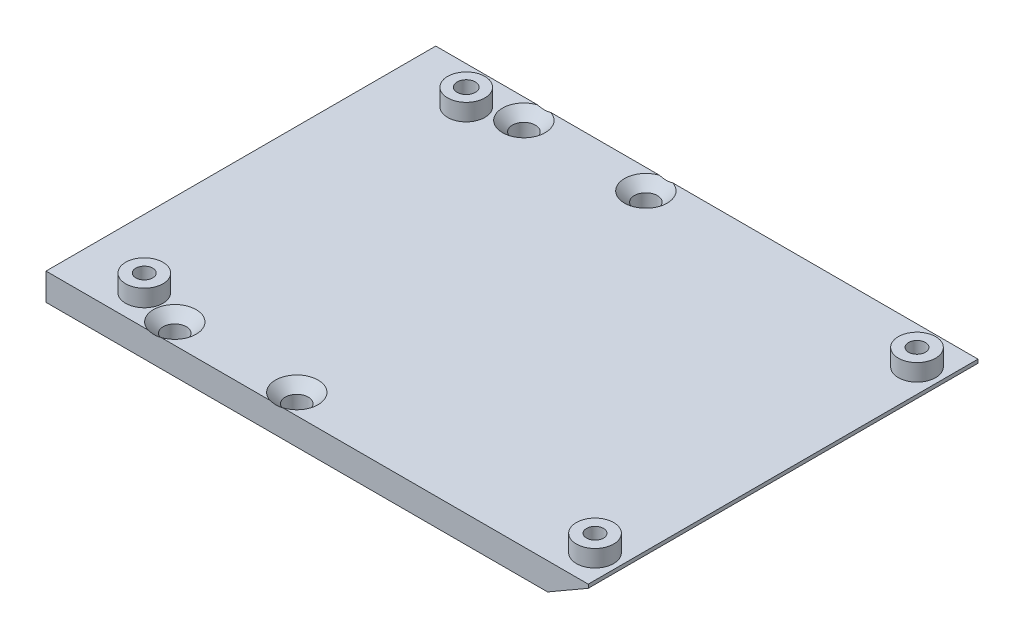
ISO-10303-21;
HEADER;
FILE_DESCRIPTION(('STEP AP214'),'2;1');
FILE_NAME('part.step','',(''),(''),'','','');
FILE_SCHEMA(('AUTOMOTIVE_DESIGN { 1 0 10303 214 1 1 1 1 }'));
ENDSEC;
DATA;
#1=APPLICATION_CONTEXT('core data for automotive mechanical design processes');
#2=APPLICATION_PROTOCOL_DEFINITION('international standard','automotive_design',2000,#1);
#3=PRODUCT_CONTEXT('',#1,'mechanical');
#4=PRODUCT('Part','Part','',(#3));
#5=PRODUCT_RELATED_PRODUCT_CATEGORY('part','',(#4));
#6=PRODUCT_DEFINITION_FORMATION('','',#4);
#7=PRODUCT_DEFINITION_CONTEXT('part definition',#1,'design');
#8=PRODUCT_DEFINITION('design','',#6,#7);
#9=PRODUCT_DEFINITION_SHAPE('','',#8);
#10=(LENGTH_UNIT() NAMED_UNIT(*) SI_UNIT(.MILLI.,.METRE.));
#11=(NAMED_UNIT(*) PLANE_ANGLE_UNIT() SI_UNIT($,.RADIAN.));
#12=(NAMED_UNIT(*) SI_UNIT($,.STERADIAN.) SOLID_ANGLE_UNIT());
#13=UNCERTAINTY_MEASURE_WITH_UNIT(LENGTH_MEASURE(1.E-05),#10,'distance_accuracy_value','');
#14=(GEOMETRIC_REPRESENTATION_CONTEXT(3) GLOBAL_UNCERTAINTY_ASSIGNED_CONTEXT((#13)) GLOBAL_UNIT_ASSIGNED_CONTEXT((#10,
#11,#12)) REPRESENTATION_CONTEXT('',''));
#15=CARTESIAN_POINT('',(0.,0.,0.));
#16=DIRECTION('',(0.,0.,1.));
#17=DIRECTION('',(1.,0.,0.));
#18=AXIS2_PLACEMENT_3D('',#15,#16,#17);
#19=CARTESIAN_POINT('',(80.,4.,0.));
#20=DIRECTION('',(-1.,0.,0.));
#21=DIRECTION('',(0.,0.,1.));
#22=AXIS2_PLACEMENT_3D('',#19,#20,#21);
#23=PLANE('',#22);
#24=DIRECTION('',(0.,0.,1.));
#25=VECTOR('',#24,1.);
#26=CARTESIAN_POINT('',(80.,3.46410161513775,0.));
#27=LINE('',#26,#25);
#28=CARTESIAN_POINT('',(80.,3.46410161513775,-2.));
#29=VERTEX_POINT('',#28);
#30=CARTESIAN_POINT('',(80.,3.46410161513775,55.5));
#31=VERTEX_POINT('',#30);
#32=EDGE_CURVE('E402',#29,#31,#27,.T.);
#33=ORIENTED_EDGE('',*,*,#32,.F.);
#34=DIRECTION('',(0.,-1.,0.));
#35=VECTOR('',#34,1.);
#36=CARTESIAN_POINT('',(80.,3.46410161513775,-2.));
#37=LINE('',#36,#35);
#38=CARTESIAN_POINT('',(80.,4.,-2.));
#39=VERTEX_POINT('',#38);
#40=EDGE_CURVE('E128',#39,#29,#37,.T.);
#41=ORIENTED_EDGE('',*,*,#40,.F.);
#42=DIRECTION('',(0.,0.,-1.));
#43=VECTOR('',#42,1.);
#44=CARTESIAN_POINT('',(80.,4.,0.));
#45=LINE('',#44,#43);
#46=CARTESIAN_POINT('',(80.,4.,55.5));
#47=VERTEX_POINT('',#46);
#48=EDGE_CURVE('E351',#47,#39,#45,.T.);
#49=ORIENTED_EDGE('',*,*,#48,.F.);
#50=DIRECTION('',(0.,1.,0.));
#51=VECTOR('',#50,1.);
#52=CARTESIAN_POINT('',(80.,4.,55.5));
#53=LINE('',#52,#51);
#54=EDGE_CURVE('E143',#31,#47,#53,.T.);
#55=ORIENTED_EDGE('',*,*,#54,.F.);
#56=EDGE_LOOP('',(#33,#41,#49,#55));
#57=FACE_BOUND('',#56,.T.);
#58=ADVANCED_FACE('F41',(#57),#23,.F.);
#59=CARTESIAN_POINT('',(0.,0.,0.));
#60=DIRECTION('',(0.,1.,0.));
#61=DIRECTION('',(0.,0.,1.));
#62=AXIS2_PLACEMENT_3D('',#59,#60,#61);
#63=PLANE('',#62);
#64=CARTESIAN_POINT('',(16.,0.,1.));
#65=DIRECTION('',(0.,1.,0.));
#66=DIRECTION('',(0.,0.,1.));
#67=AXIS2_PLACEMENT_3D('',#64,#65,#66);
#68=CIRCLE('',#67,1.7);
#69=CARTESIAN_POINT('',(16.,0.,2.7));
#70=VERTEX_POINT('',#69);
#71=EDGE_CURVE('E45',#70,#70,#68,.T.);
#72=ORIENTED_EDGE('',*,*,#71,.T.);
#73=EDGE_LOOP('',(#72));
#74=FACE_BOUND('',#73,.T.);
#75=CARTESIAN_POINT('',(34.,0.,1.));
#76=DIRECTION('',(0.,1.,0.));
#77=DIRECTION('',(0.,0.,1.));
#78=AXIS2_PLACEMENT_3D('',#75,#76,#77);
#79=CIRCLE('',#78,1.7);
#80=CARTESIAN_POINT('',(34.,0.,2.7));
#81=VERTEX_POINT('',#80);
#82=EDGE_CURVE('E172',#81,#81,#79,.T.);
#83=ORIENTED_EDGE('',*,*,#82,.T.);
#84=EDGE_LOOP('',(#83));
#85=FACE_BOUND('',#84,.T.);
#86=CARTESIAN_POINT('',(34.,0.,52.5));
#87=DIRECTION('',(0.,1.,0.));
#88=DIRECTION('',(0.,0.,1.));
#89=AXIS2_PLACEMENT_3D('',#86,#87,#88);
#90=CIRCLE('',#89,1.7);
#91=CARTESIAN_POINT('',(34.,0.,54.2));
#92=VERTEX_POINT('',#91);
#93=EDGE_CURVE('E166',#92,#92,#90,.T.);
#94=ORIENTED_EDGE('',*,*,#93,.T.);
#95=EDGE_LOOP('',(#94));
#96=FACE_BOUND('',#95,.T.);
#97=CARTESIAN_POINT('',(16.,0.,52.5));
#98=DIRECTION('',(0.,1.,0.));
#99=DIRECTION('',(0.,0.,1.));
#100=AXIS2_PLACEMENT_3D('',#97,#98,#99);
#101=CIRCLE('',#100,1.7);
#102=CARTESIAN_POINT('',(16.,0.,54.2));
#103=VERTEX_POINT('',#102);
#104=EDGE_CURVE('E163',#103,#103,#101,.T.);
#105=ORIENTED_EDGE('',*,*,#104,.T.);
#106=EDGE_LOOP('',(#105));
#107=FACE_BOUND('',#106,.T.);
#108=CARTESIAN_POINT('',(10.,0.,51.));
#109=DIRECTION('',(0.,1.,0.));
#110=DIRECTION('',(0.,0.,1.));
#111=AXIS2_PLACEMENT_3D('',#108,#109,#110);
#112=CIRCLE('',#111,1.24999999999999);
#113=CARTESIAN_POINT('',(10.,0.,52.25));
#114=VERTEX_POINT('',#113);
#115=EDGE_CURVE('E355',#114,#114,#112,.T.);
#116=ORIENTED_EDGE('',*,*,#115,.T.);
#117=EDGE_LOOP('',(#116));
#118=FACE_BOUND('',#117,.T.);
#119=CARTESIAN_POINT('',(10.,0.,3.5));
#120=DIRECTION('',(0.,1.,0.));
#121=DIRECTION('',(0.,0.,1.));
#122=AXIS2_PLACEMENT_3D('',#119,#120,#121);
#123=CIRCLE('',#122,1.24999999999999);
#124=CARTESIAN_POINT('',(10.,0.,4.74999999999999));
#125=VERTEX_POINT('',#124);
#126=EDGE_CURVE('E360',#125,#125,#123,.T.);
#127=ORIENTED_EDGE('',*,*,#126,.T.);
#128=EDGE_LOOP('',(#127));
#129=FACE_BOUND('',#128,.T.);
#130=DIRECTION('',(0.,0.,-1.));
#131=VECTOR('',#130,1.);
#132=CARTESIAN_POINT('',(74.,0.,0.));
#133=LINE('',#132,#131);
#134=CARTESIAN_POINT('',(74.,0.,55.5));
#135=VERTEX_POINT('',#134);
#136=CARTESIAN_POINT('',(74.,0.,-2.));
#137=VERTEX_POINT('',#136);
#138=EDGE_CURVE('E404',#135,#137,#133,.T.);
#139=ORIENTED_EDGE('',*,*,#138,.F.);
#140=DIRECTION('',(1.,0.,0.));
#141=VECTOR('',#140,1.);
#142=CARTESIAN_POINT('',(74.,0.,55.5));
#143=LINE('',#142,#141);
#144=CARTESIAN_POINT('',(0.,0.,55.5));
#145=VERTEX_POINT('',#144);
#146=EDGE_CURVE('E149',#145,#135,#143,.T.);
#147=ORIENTED_EDGE('',*,*,#146,.F.);
#148=DIRECTION('',(0.,0.,1.));
#149=VECTOR('',#148,1.);
#150=CARTESIAN_POINT('',(0.,0.,0.));
#151=LINE('',#150,#149);
#152=CARTESIAN_POINT('',(0.,0.,-2.));
#153=VERTEX_POINT('',#152);
#154=EDGE_CURVE('E352',#153,#145,#151,.T.);
#155=ORIENTED_EDGE('',*,*,#154,.F.);
#156=DIRECTION('',(-1.,0.,0.));
#157=VECTOR('',#156,1.);
#158=CARTESIAN_POINT('',(0.,0.,-2.));
#159=LINE('',#158,#157);
#160=EDGE_CURVE('E137',#137,#153,#159,.T.);
#161=ORIENTED_EDGE('',*,*,#160,.F.);
#162=EDGE_LOOP('',(#139,#147,#155,#161));
#163=FACE_BOUND('',#162,.T.);
#164=ADVANCED_FACE('F183',(#74,#85,#96,#107,#118,#129,#163),#63,.F.);
#165=CARTESIAN_POINT('',(76.5,4.,51.));
#166=DIRECTION('',(0.,1.,0.));
#167=DIRECTION('',(0.,0.,1.));
#168=AXIS2_PLACEMENT_3D('',#165,#166,#167);
#169=CYLINDRICAL_SURFACE('',#168,1.24999999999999);
#170=CARTESIAN_POINT('',(76.5,6.5,51.));
#171=DIRECTION('',(0.,1.,0.));
#172=DIRECTION('',(0.,0.,1.));
#173=AXIS2_PLACEMENT_3D('',#170,#171,#172);
#174=CIRCLE('',#173,1.24999999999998);
#175=CARTESIAN_POINT('',(76.5,6.5,52.25));
#176=VERTEX_POINT('',#175);
#177=EDGE_CURVE('E370',#176,#176,#174,.T.);
#178=ORIENTED_EDGE('',*,*,#177,.T.);
#179=EDGE_LOOP('',(#178));
#180=FACE_BOUND('',#179,.T.);
#181=CARTESIAN_POINT('',(76.5,1.44337567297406,51.));
#182=DIRECTION('',(0.499999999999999,-0.86602540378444,0.));
#183=DIRECTION('',(0.86602540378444,0.499999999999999,0.));
#184=AXIS2_PLACEMENT_3D('',#181,#182,#183);
#185=ELLIPSE('',#184,1.44337567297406,1.24999999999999);
#186=CARTESIAN_POINT('',(77.75,2.16506350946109,51.));
#187=VERTEX_POINT('',#186);
#188=EDGE_CURVE('E348',#187,#187,#185,.F.);
#189=ORIENTED_EDGE('',*,*,#188,.F.);
#190=EDGE_LOOP('',(#189));
#191=FACE_BOUND('',#190,.T.);
#192=ADVANCED_FACE('F204',(#180,#191),#169,.F.);
#193=CARTESIAN_POINT('',(76.5,4.,3.5));
#194=DIRECTION('',(0.,1.,0.));
#195=DIRECTION('',(0.,0.,1.));
#196=AXIS2_PLACEMENT_3D('',#193,#194,#195);
#197=CYLINDRICAL_SURFACE('',#196,1.24999999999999);
#198=CARTESIAN_POINT('',(76.5,6.5,3.5));
#199=DIRECTION('',(0.,1.,0.));
#200=DIRECTION('',(0.,0.,1.));
#201=AXIS2_PLACEMENT_3D('',#198,#199,#200);
#202=CIRCLE('',#201,1.24999999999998);
#203=CARTESIAN_POINT('',(76.5,6.5,4.74999999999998));
#204=VERTEX_POINT('',#203);
#205=EDGE_CURVE('E379',#204,#204,#202,.T.);
#206=ORIENTED_EDGE('',*,*,#205,.T.);
#207=EDGE_LOOP('',(#206));
#208=FACE_BOUND('',#207,.T.);
#209=CARTESIAN_POINT('',(76.5,1.44337567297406,3.5));
#210=DIRECTION('',(0.499999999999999,-0.86602540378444,0.));
#211=DIRECTION('',(0.86602540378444,0.499999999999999,0.));
#212=AXIS2_PLACEMENT_3D('',#209,#210,#211);
#213=ELLIPSE('',#212,1.44337567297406,1.24999999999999);
#214=CARTESIAN_POINT('',(77.75,2.16506350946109,3.5));
#215=VERTEX_POINT('',#214);
#216=EDGE_CURVE('E132',#215,#215,#213,.F.);
#217=ORIENTED_EDGE('',*,*,#216,.F.);
#218=EDGE_LOOP('',(#217));
#219=FACE_BOUND('',#218,.T.);
#220=ADVANCED_FACE('F217',(#208,#219),#197,.F.);
#221=CARTESIAN_POINT('',(0.,4.,0.));
#222=DIRECTION('',(0.,1.,0.));
#223=DIRECTION('',(0.,0.,1.));
#224=AXIS2_PLACEMENT_3D('',#221,#222,#223);
#225=PLANE('',#224);
#226=CARTESIAN_POINT('',(10.,4.,3.5));
#227=DIRECTION('',(0.,1.,0.));
#228=DIRECTION('',(0.,0.,1.));
#229=AXIS2_PLACEMENT_3D('',#226,#227,#228);
#230=CIRCLE('',#229,1.24999999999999);
#231=CARTESIAN_POINT('',(10.,4.,4.74999999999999));
#232=VERTEX_POINT('',#231);
#233=EDGE_CURVE('E363',#232,#232,#230,.T.);
#234=ORIENTED_EDGE('',*,*,#233,.F.);
#235=EDGE_LOOP('',(#234));
#236=FACE_BOUND('',#235,.T.);
#237=CARTESIAN_POINT('',(10.,4.,3.5));
#238=DIRECTION('',(0.,1.,0.));
#239=DIRECTION('',(0.,0.,1.));
#240=AXIS2_PLACEMENT_3D('',#237,#238,#239);
#241=CIRCLE('',#240,1.34209348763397);
#242=CARTESIAN_POINT('',(10.,4.,4.84209348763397));
#243=VERTEX_POINT('',#242);
#244=EDGE_CURVE('E345',#243,#243,#241,.F.);
#245=ORIENTED_EDGE('',*,*,#244,.F.);
#246=EDGE_LOOP('',(#245));
#247=FACE_BOUND('',#246,.T.);
#248=ADVANCED_FACE('F209',(#236,#247),#225,.T.);
#249=CARTESIAN_POINT('',(16.,4.,1.));
#250=DIRECTION('',(0.,1.,0.));
#251=DIRECTION('',(0.,0.,1.));
#252=AXIS2_PLACEMENT_3D('',#249,#250,#251);
#253=CIRCLE('',#252,3.15);
#254=CARTESIAN_POINT('',(15.0395313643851,4.,-2.));
#255=VERTEX_POINT('',#254);
#256=CARTESIAN_POINT('',(16.9604686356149,4.,-2.));
#257=VERTEX_POINT('',#256);
#258=EDGE_CURVE('E56',#255,#257,#253,.T.);
#259=ORIENTED_EDGE('',*,*,#258,.F.);
#260=DIRECTION('',(1.,0.,0.));
#261=VECTOR('',#260,1.);
#262=CARTESIAN_POINT('',(80.,4.,-2.));
#263=LINE('',#262,#261);
#264=CARTESIAN_POINT('',(0.,4.,-2.));
#265=VERTEX_POINT('',#264);
#266=EDGE_CURVE('E119',#265,#255,#263,.T.);
#267=ORIENTED_EDGE('',*,*,#266,.F.);
#268=DIRECTION('',(0.,0.,1.));
#269=VECTOR('',#268,1.);
#270=CARTESIAN_POINT('',(0.,4.,0.));
#271=LINE('',#270,#269);
#272=CARTESIAN_POINT('',(0.,4.,55.5));
#273=VERTEX_POINT('',#272);
#274=EDGE_CURVE('E354',#265,#273,#271,.T.);
#275=ORIENTED_EDGE('',*,*,#274,.T.);
#276=DIRECTION('',(-1.,0.,0.));
#277=VECTOR('',#276,1.);
#278=CARTESIAN_POINT('',(0.,4.,55.5));
#279=LINE('',#278,#277);
#280=CARTESIAN_POINT('',(15.0395313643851,4.,55.5));
#281=VERTEX_POINT('',#280);
#282=EDGE_CURVE('E159',#281,#273,#279,.T.);
#283=ORIENTED_EDGE('',*,*,#282,.F.);
#284=CARTESIAN_POINT('',(16.,4.,52.5));
#285=DIRECTION('',(0.,1.,0.));
#286=DIRECTION('',(0.,0.,1.));
#287=AXIS2_PLACEMENT_3D('',#284,#285,#286);
#288=CIRCLE('',#287,3.15);
#289=CARTESIAN_POINT('',(16.9604686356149,4.,55.5));
#290=VERTEX_POINT('',#289);
#291=EDGE_CURVE('E164',#290,#281,#288,.T.);
#292=ORIENTED_EDGE('',*,*,#291,.F.);
#293=CARTESIAN_POINT('',(33.0395313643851,4.,55.5));
#294=VERTEX_POINT('',#293);
#295=EDGE_CURVE('E158',#294,#290,#279,.T.);
#296=ORIENTED_EDGE('',*,*,#295,.F.);
#297=CARTESIAN_POINT('',(34.,4.,52.5));
#298=DIRECTION('',(0.,1.,0.));
#299=DIRECTION('',(0.,0.,1.));
#300=AXIS2_PLACEMENT_3D('',#297,#298,#299);
#301=CIRCLE('',#300,3.15);
#302=CARTESIAN_POINT('',(34.9604686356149,4.,55.5));
#303=VERTEX_POINT('',#302);
#304=EDGE_CURVE('E170',#303,#294,#301,.T.);
#305=ORIENTED_EDGE('',*,*,#304,.F.);
#306=EDGE_CURVE('E155',#47,#303,#279,.T.);
#307=ORIENTED_EDGE('',*,*,#306,.F.);
#308=ORIENTED_EDGE('',*,*,#48,.T.);
#309=CARTESIAN_POINT('',(34.9604686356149,4.,-2.));
#310=VERTEX_POINT('',#309);
#311=EDGE_CURVE('E130',#310,#39,#263,.T.);
#312=ORIENTED_EDGE('',*,*,#311,.F.);
#313=CARTESIAN_POINT('',(34.,4.,1.));
#314=DIRECTION('',(0.,1.,0.));
#315=DIRECTION('',(0.,0.,1.));
#316=AXIS2_PLACEMENT_3D('',#313,#314,#315);
#317=CIRCLE('',#316,3.15);
#318=CARTESIAN_POINT('',(33.0395313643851,4.,-2.));
#319=VERTEX_POINT('',#318);
#320=EDGE_CURVE('E62',#319,#310,#317,.T.);
#321=ORIENTED_EDGE('',*,*,#320,.F.);
#322=EDGE_CURVE('E120',#257,#319,#263,.T.);
#323=ORIENTED_EDGE('',*,*,#322,.F.);
#324=EDGE_LOOP('',(#259,#267,#275,#283,#292,#296,#305,#307,#308,#312,#321,#323));
#325=FACE_BOUND('',#324,.T.);
#326=CARTESIAN_POINT('',(10.,4.,3.5));
#327=DIRECTION('',(0.,1.,0.));
#328=DIRECTION('',(0.,0.,1.));
#329=AXIS2_PLACEMENT_3D('',#326,#327,#328);
#330=CIRCLE('',#329,2.75);
#331=CARTESIAN_POINT('',(10.,4.,6.25));
#332=VERTEX_POINT('',#331);
#333=EDGE_CURVE('E394',#332,#332,#330,.T.);
#334=ORIENTED_EDGE('',*,*,#333,.F.);
#335=EDGE_LOOP('',(#334));
#336=FACE_BOUND('',#335,.T.);
#337=CARTESIAN_POINT('',(76.5,4.,3.5));
#338=DIRECTION('',(0.,1.,0.));
#339=DIRECTION('',(0.,0.,1.));
#340=AXIS2_PLACEMENT_3D('',#337,#338,#339);
#341=CIRCLE('',#340,2.75000000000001);
#342=CARTESIAN_POINT('',(76.5,4.,6.25000000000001));
#343=VERTEX_POINT('',#342);
#344=EDGE_CURVE('E376',#343,#343,#341,.T.);
#345=ORIENTED_EDGE('',*,*,#344,.F.);
#346=EDGE_LOOP('',(#345));
#347=FACE_BOUND('',#346,.T.);
#348=CARTESIAN_POINT('',(76.5,4.,51.));
#349=DIRECTION('',(0.,1.,0.));
#350=DIRECTION('',(0.,0.,1.));
#351=AXIS2_PLACEMENT_3D('',#348,#349,#350);
#352=CIRCLE('',#351,2.75000000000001);
#353=CARTESIAN_POINT('',(76.5,4.,53.75));
#354=VERTEX_POINT('',#353);
#355=EDGE_CURVE('E367',#354,#354,#352,.T.);
#356=ORIENTED_EDGE('',*,*,#355,.F.);
#357=EDGE_LOOP('',(#356));
#358=FACE_BOUND('',#357,.T.);
#359=CARTESIAN_POINT('',(10.,4.,51.));
#360=DIRECTION('',(0.,1.,0.));
#361=DIRECTION('',(0.,0.,1.));
#362=AXIS2_PLACEMENT_3D('',#359,#360,#361);
#363=CIRCLE('',#362,2.75);
#364=CARTESIAN_POINT('',(10.,4.,53.75));
#365=VERTEX_POINT('',#364);
#366=EDGE_CURVE('E385',#365,#365,#363,.T.);
#367=ORIENTED_EDGE('',*,*,#366,.F.);
#368=EDGE_LOOP('',(#367));
#369=FACE_BOUND('',#368,.T.);
#370=ADVANCED_FACE('F116',(#325,#336,#347,#358,#369),#225,.T.);
#371=CARTESIAN_POINT('',(0.,4.,0.));
#372=DIRECTION('',(1.,0.,0.));
#373=DIRECTION('',(0.,0.,-1.));
#374=AXIS2_PLACEMENT_3D('',#371,#372,#373);
#375=PLANE('',#374);
#376=ORIENTED_EDGE('',*,*,#154,.T.);
#377=DIRECTION('',(0.,-1.,0.));
#378=VECTOR('',#377,1.);
#379=CARTESIAN_POINT('',(0.,0.,55.5));
#380=LINE('',#379,#378);
#381=EDGE_CURVE('E152',#273,#145,#380,.T.);
#382=ORIENTED_EDGE('',*,*,#381,.F.);
#383=ORIENTED_EDGE('',*,*,#274,.F.);
#384=DIRECTION('',(0.,1.,0.));
#385=VECTOR('',#384,1.);
#386=CARTESIAN_POINT('',(0.,4.,-2.));
#387=LINE('',#386,#385);
#388=EDGE_CURVE('E127',#153,#265,#387,.T.);
#389=ORIENTED_EDGE('',*,*,#388,.F.);
#390=EDGE_LOOP('',(#376,#382,#383,#389));
#391=FACE_BOUND('',#390,.T.);
#392=ADVANCED_FACE('F43',(#391),#375,.F.);
#393=CARTESIAN_POINT('',(10.,4.,51.));
#394=DIRECTION('',(0.,1.,0.));
#395=DIRECTION('',(0.,0.,1.));
#396=AXIS2_PLACEMENT_3D('',#393,#394,#395);
#397=CYLINDRICAL_SURFACE('',#396,1.24999999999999);
#398=ORIENTED_EDGE('',*,*,#115,.F.);
#399=EDGE_LOOP('',(#398));
#400=FACE_BOUND('',#399,.T.);
#401=CARTESIAN_POINT('',(10.,6.5,51.));
#402=DIRECTION('',(0.,1.,0.));
#403=DIRECTION('',(0.,0.,1.));
#404=AXIS2_PLACEMENT_3D('',#401,#402,#403);
#405=CIRCLE('',#404,1.24999999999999);
#406=CARTESIAN_POINT('',(10.,6.5,52.25));
#407=VERTEX_POINT('',#406);
#408=EDGE_CURVE('E388',#407,#407,#405,.T.);
#409=ORIENTED_EDGE('',*,*,#408,.T.);
#410=EDGE_LOOP('',(#409));
#411=FACE_BOUND('',#410,.T.);
#412=ADVANCED_FACE('F210',(#400,#411),#397,.F.);
#413=CARTESIAN_POINT('',(10.,4.,3.5));
#414=DIRECTION('',(0.,1.,0.));
#415=DIRECTION('',(0.,0.,1.));
#416=AXIS2_PLACEMENT_3D('',#413,#414,#415);
#417=CYLINDRICAL_SURFACE('',#416,1.24999999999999);
#418=ORIENTED_EDGE('',*,*,#126,.F.);
#419=EDGE_LOOP('',(#418));
#420=FACE_BOUND('',#419,.T.);
#421=ORIENTED_EDGE('',*,*,#233,.T.);
#422=EDGE_LOOP('',(#421));
#423=FACE_BOUND('',#422,.T.);
#424=ADVANCED_FACE('F213',(#420,#423),#417,.F.);
#425=CARTESIAN_POINT('',(76.5,6.5,51.));
#426=DIRECTION('',(0.,1.,0.));
#427=DIRECTION('',(0.,0.,1.));
#428=AXIS2_PLACEMENT_3D('',#425,#426,#427);
#429=PLANE('',#428);
#430=CARTESIAN_POINT('',(76.5,6.5,51.));
#431=DIRECTION('',(0.,1.,0.));
#432=DIRECTION('',(0.,0.,1.));
#433=AXIS2_PLACEMENT_3D('',#430,#431,#432);
#434=CIRCLE('',#433,2.75000000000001);
#435=CARTESIAN_POINT('',(76.5,6.5,53.75));
#436=VERTEX_POINT('',#435);
#437=EDGE_CURVE('E366',#436,#436,#434,.T.);
#438=ORIENTED_EDGE('',*,*,#437,.T.);
#439=EDGE_LOOP('',(#438));
#440=FACE_BOUND('',#439,.T.);
#441=ORIENTED_EDGE('',*,*,#177,.F.);
#442=EDGE_LOOP('',(#441));
#443=FACE_BOUND('',#442,.T.);
#444=ADVANCED_FACE('F224',(#440,#443),#429,.T.);
#445=CARTESIAN_POINT('',(76.5,6.5,51.));
#446=DIRECTION('',(0.,-1.,0.));
#447=DIRECTION('',(0.,0.,-1.));
#448=AXIS2_PLACEMENT_3D('',#445,#446,#447);
#449=CYLINDRICAL_SURFACE('',#448,2.75000000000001);
#450=ORIENTED_EDGE('',*,*,#437,.F.);
#451=EDGE_LOOP('',(#450));
#452=FACE_BOUND('',#451,.T.);
#453=ORIENTED_EDGE('',*,*,#355,.T.);
#454=EDGE_LOOP('',(#453));
#455=FACE_BOUND('',#454,.T.);
#456=ADVANCED_FACE('F226',(#452,#455),#449,.T.);
#457=CARTESIAN_POINT('',(76.5,6.5,3.5));
#458=DIRECTION('',(0.,1.,0.));
#459=DIRECTION('',(0.,0.,1.));
#460=AXIS2_PLACEMENT_3D('',#457,#458,#459);
#461=PLANE('',#460);
#462=CARTESIAN_POINT('',(76.5,6.5,3.5));
#463=DIRECTION('',(0.,1.,0.));
#464=DIRECTION('',(0.,0.,1.));
#465=AXIS2_PLACEMENT_3D('',#462,#463,#464);
#466=CIRCLE('',#465,2.75000000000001);
#467=CARTESIAN_POINT('',(76.5,6.5,6.25000000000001));
#468=VERTEX_POINT('',#467);
#469=EDGE_CURVE('E375',#468,#468,#466,.T.);
#470=ORIENTED_EDGE('',*,*,#469,.T.);
#471=EDGE_LOOP('',(#470));
#472=FACE_BOUND('',#471,.T.);
#473=ORIENTED_EDGE('',*,*,#205,.F.);
#474=EDGE_LOOP('',(#473));
#475=FACE_BOUND('',#474,.T.);
#476=ADVANCED_FACE('F229',(#472,#475),#461,.T.);
#477=CARTESIAN_POINT('',(76.5,6.5,3.5));
#478=DIRECTION('',(0.,-1.,0.));
#479=DIRECTION('',(0.,0.,-1.));
#480=AXIS2_PLACEMENT_3D('',#477,#478,#479);
#481=CYLINDRICAL_SURFACE('',#480,2.75000000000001);
#482=ORIENTED_EDGE('',*,*,#469,.F.);
#483=EDGE_LOOP('',(#482));
#484=FACE_BOUND('',#483,.T.);
#485=ORIENTED_EDGE('',*,*,#344,.T.);
#486=EDGE_LOOP('',(#485));
#487=FACE_BOUND('',#486,.T.);
#488=ADVANCED_FACE('F234',(#484,#487),#481,.T.);
#489=CARTESIAN_POINT('',(10.,6.5,51.));
#490=DIRECTION('',(0.,1.,0.));
#491=DIRECTION('',(0.,0.,1.));
#492=AXIS2_PLACEMENT_3D('',#489,#490,#491);
#493=PLANE('',#492);
#494=CARTESIAN_POINT('',(10.,6.5,51.));
#495=DIRECTION('',(0.,1.,0.));
#496=DIRECTION('',(0.,0.,1.));
#497=AXIS2_PLACEMENT_3D('',#494,#495,#496);
#498=CIRCLE('',#497,2.75);
#499=CARTESIAN_POINT('',(10.,6.5,53.75));
#500=VERTEX_POINT('',#499);
#501=EDGE_CURVE('E384',#500,#500,#498,.T.);
#502=ORIENTED_EDGE('',*,*,#501,.T.);
#503=EDGE_LOOP('',(#502));
#504=FACE_BOUND('',#503,.T.);
#505=ORIENTED_EDGE('',*,*,#408,.F.);
#506=EDGE_LOOP('',(#505));
#507=FACE_BOUND('',#506,.T.);
#508=ADVANCED_FACE('F237',(#504,#507),#493,.T.);
#509=CARTESIAN_POINT('',(10.,6.5,51.));
#510=DIRECTION('',(0.,-1.,0.));
#511=DIRECTION('',(0.,0.,-1.));
#512=AXIS2_PLACEMENT_3D('',#509,#510,#511);
#513=CYLINDRICAL_SURFACE('',#512,2.75);
#514=ORIENTED_EDGE('',*,*,#501,.F.);
#515=EDGE_LOOP('',(#514));
#516=FACE_BOUND('',#515,.T.);
#517=ORIENTED_EDGE('',*,*,#366,.T.);
#518=EDGE_LOOP('',(#517));
#519=FACE_BOUND('',#518,.T.);
#520=ADVANCED_FACE('F242',(#516,#519),#513,.T.);
#521=CARTESIAN_POINT('',(10.,6.5,3.5));
#522=DIRECTION('',(0.,1.,0.));
#523=DIRECTION('',(0.,0.,1.));
#524=AXIS2_PLACEMENT_3D('',#521,#522,#523);
#525=PLANE('',#524);
#526=CARTESIAN_POINT('',(10.,6.5,3.5));
#527=DIRECTION('',(0.,1.,0.));
#528=DIRECTION('',(0.,0.,1.));
#529=AXIS2_PLACEMENT_3D('',#526,#527,#528);
#530=CIRCLE('',#529,2.75);
#531=CARTESIAN_POINT('',(10.,6.5,6.25));
#532=VERTEX_POINT('',#531);
#533=EDGE_CURVE('E393',#532,#532,#530,.T.);
#534=ORIENTED_EDGE('',*,*,#533,.T.);
#535=EDGE_LOOP('',(#534));
#536=FACE_BOUND('',#535,.T.);
#537=CARTESIAN_POINT('',(10.,6.5,3.5));
#538=DIRECTION('',(0.,1.,0.));
#539=DIRECTION('',(0.,0.,1.));
#540=AXIS2_PLACEMENT_3D('',#537,#538,#539);
#541=CIRCLE('',#540,1.34209348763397);
#542=CARTESIAN_POINT('',(10.,6.5,4.84209348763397));
#543=VERTEX_POINT('',#542);
#544=EDGE_CURVE('E397',#543,#543,#541,.T.);
#545=ORIENTED_EDGE('',*,*,#544,.F.);
#546=EDGE_LOOP('',(#545));
#547=FACE_BOUND('',#546,.T.);
#548=ADVANCED_FACE('F245',(#536,#547),#525,.T.);
#549=CARTESIAN_POINT('',(10.,6.5,3.5));
#550=DIRECTION('',(0.,-1.,0.));
#551=DIRECTION('',(0.,0.,-1.));
#552=AXIS2_PLACEMENT_3D('',#549,#550,#551);
#553=CYLINDRICAL_SURFACE('',#552,2.75);
#554=ORIENTED_EDGE('',*,*,#533,.F.);
#555=EDGE_LOOP('',(#554));
#556=FACE_BOUND('',#555,.T.);
#557=ORIENTED_EDGE('',*,*,#333,.T.);
#558=EDGE_LOOP('',(#557));
#559=FACE_BOUND('',#558,.T.);
#560=ADVANCED_FACE('F250',(#556,#559),#553,.T.);
#561=CARTESIAN_POINT('',(10.,6.5,3.5));
#562=DIRECTION('',(0.,-1.,0.));
#563=DIRECTION('',(0.,0.,-1.));
#564=AXIS2_PLACEMENT_3D('',#561,#562,#563);
#565=CYLINDRICAL_SURFACE('',#564,1.34209348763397);
#566=ORIENTED_EDGE('',*,*,#544,.T.);
#567=EDGE_LOOP('',(#566));
#568=FACE_BOUND('',#567,.T.);
#569=ORIENTED_EDGE('',*,*,#244,.T.);
#570=EDGE_LOOP('',(#569));
#571=FACE_BOUND('',#570,.T.);
#572=ADVANCED_FACE('F253',(#568,#571),#565,.F.);
#573=CARTESIAN_POINT('',(77.4479239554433,1.99065982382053,27.0200454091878));
#574=DIRECTION('',(0.499999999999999,-0.86602540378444,0.));
#575=DIRECTION('',(0.86602540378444,0.499999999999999,0.));
#576=AXIS2_PLACEMENT_3D('',#573,#574,#575);
#577=PLANE('',#576);
#578=ORIENTED_EDGE('',*,*,#188,.T.);
#579=EDGE_LOOP('',(#578));
#580=FACE_BOUND('',#579,.T.);
#581=ORIENTED_EDGE('',*,*,#216,.T.);
#582=EDGE_LOOP('',(#581));
#583=FACE_BOUND('',#582,.T.);
#584=ORIENTED_EDGE('',*,*,#32,.T.);
#585=DIRECTION('',(0.86602540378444,0.499999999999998,0.));
#586=VECTOR('',#585,1.);
#587=CARTESIAN_POINT('',(80.,3.46410161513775,55.5));
#588=LINE('',#587,#586);
#589=EDGE_CURVE('E146',#135,#31,#588,.T.);
#590=ORIENTED_EDGE('',*,*,#589,.F.);
#591=ORIENTED_EDGE('',*,*,#138,.T.);
#592=DIRECTION('',(-0.866025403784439,-0.499999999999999,0.));
#593=VECTOR('',#592,1.);
#594=CARTESIAN_POINT('',(74.,0.,-2.));
#595=LINE('',#594,#593);
#596=EDGE_CURVE('E138',#29,#137,#595,.T.);
#597=ORIENTED_EDGE('',*,*,#596,.F.);
#598=EDGE_LOOP('',(#584,#590,#591,#597));
#599=FACE_BOUND('',#598,.T.);
#600=ADVANCED_FACE('F260',(#580,#583,#599),#577,.T.);
#601=CARTESIAN_POINT('',(0.,0.,-2.));
#602=DIRECTION('',(0.,0.,1.));
#603=DIRECTION('',(1.,0.,0.));
#604=AXIS2_PLACEMENT_3D('',#601,#602,#603);
#605=PLANE('',#604);
#606=ORIENTED_EDGE('',*,*,#266,.T.);
#607=CARTESIAN_POINT('',(6.62295776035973,10.6952486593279,-2.));
#608=CARTESIAN_POINT('',(6.84438141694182,10.4843740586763,-2.));
#609=CARTESIAN_POINT('',(7.06613421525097,10.2738433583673,-2.));
#610=CARTESIAN_POINT('',(7.51050447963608,9.85367734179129,-2.));
#611=CARTESIAN_POINT('',(7.73312198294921,9.64404206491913,-2.));
#612=CARTESIAN_POINT('',(8.17996544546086,9.22537132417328,-2.));
#613=CARTESIAN_POINT('',(8.40419403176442,9.01633866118,-2.));
#614=CARTESIAN_POINT('',(8.85398815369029,8.59972845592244,-2.));
#615=CARTESIAN_POINT('',(9.07955365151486,8.39215087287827,-2.));
#616=CARTESIAN_POINT('',(9.55853504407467,7.95505197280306,-2.));
#617=CARTESIAN_POINT('',(9.8121621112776,7.72576148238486,-2.));
#618=CARTESIAN_POINT('',(10.322378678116,7.27044558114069,-2.));
#619=CARTESIAN_POINT('',(10.5789684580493,7.04442048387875,-2.));
#620=CARTESIAN_POINT('',(11.0958985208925,6.59745425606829,-2.));
#621=CARTESIAN_POINT('',(11.3562326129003,6.37650602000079,-2.));
#622=CARTESIAN_POINT('',(11.7512614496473,6.05060765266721,-2.));
#623=CARTESIAN_POINT('',(11.8836821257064,5.94290349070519,-2.));
#624=CARTESIAN_POINT('',(12.1504016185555,5.72985048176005,-2.));
#625=CARTESIAN_POINT('',(12.2847003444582,5.624501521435,-2.));
#626=CARTESIAN_POINT('',(12.5233793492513,5.44156921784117,-2.));
#627=CARTESIAN_POINT('',(12.6272695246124,5.36334733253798,-2.));
#628=CARTESIAN_POINT('',(12.8366684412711,5.20908789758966,-2.));
#629=CARTESIAN_POINT('',(12.9421772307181,5.13305041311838,-2.));
#630=CARTESIAN_POINT('',(13.1553484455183,4.98355241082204,-2.));
#631=CARTESIAN_POINT('',(13.2630149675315,4.91009770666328,-2.));
#632=CARTESIAN_POINT('',(13.4806496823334,4.76668493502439,-2.));
#633=CARTESIAN_POINT('',(13.5906177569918,4.69672668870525,-2.));
#634=CARTESIAN_POINT('',(13.810710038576,4.56288848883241,-2.));
#635=CARTESIAN_POINT('',(13.9207698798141,4.49890434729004,-2.));
#636=CARTESIAN_POINT('',(14.1439284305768,4.3765119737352,-2.));
#637=CARTESIAN_POINT('',(14.2570279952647,4.31810533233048,-2.));
#638=CARTESIAN_POINT('',(14.6008332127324,4.1541168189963,-2.));
#639=CARTESIAN_POINT('',(14.8371126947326,4.05908052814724,-2.));
#640=CARTESIAN_POINT('',(15.1547755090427,3.96598284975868,-2.));
#641=CARTESIAN_POINT('',(15.2299367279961,3.94637750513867,-2.));
#642=CARTESIAN_POINT('',(15.3814291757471,3.91221849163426,-2.));
#643=CARTESIAN_POINT('',(15.4577605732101,3.89766555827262,-2.));
#644=CARTESIAN_POINT('',(15.6111096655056,3.87415480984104,-2.));
#645=CARTESIAN_POINT('',(15.6881253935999,3.86518428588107,-2.));
#646=CARTESIAN_POINT('',(15.8426165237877,3.85313800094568,-2.));
#647=CARTESIAN_POINT('',(15.9200919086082,3.85006201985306,-2.));
#648=CARTESIAN_POINT('',(16.0895530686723,3.84992852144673,-2.));
#649=CARTESIAN_POINT('',(16.1815422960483,3.85410439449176,-2.));
#650=CARTESIAN_POINT('',(16.364768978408,3.87071560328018,-2.));
#651=CARTESIAN_POINT('',(16.4560063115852,3.88315225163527,-2.));
#652=CARTESIAN_POINT('',(16.6374687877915,3.91567448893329,-2.));
#653=CARTESIAN_POINT('',(16.7276883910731,3.93579060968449,-2.));
#654=CARTESIAN_POINT('',(16.9063379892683,3.98273350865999,-2.));
#655=CARTESIAN_POINT('',(16.9947678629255,4.00956073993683,-2.));
#656=CARTESIAN_POINT('',(17.271596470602,4.10348442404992,-2.));
#657=CARTESIAN_POINT('',(17.4564545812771,4.18108705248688,-2.));
#658=CARTESIAN_POINT('',(17.7272033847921,4.3107748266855,-2.));
#659=CARTESIAN_POINT('',(17.8164576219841,4.35627532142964,-2.));
#660=CARTESIAN_POINT('',(17.9930210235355,4.45091312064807,-2.));
#661=CARTESIAN_POINT('',(18.080330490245,4.50004985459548,-2.));
#662=CARTESIAN_POINT('',(18.254428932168,4.60198623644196,-2.));
#663=CARTESIAN_POINT('',(18.3411930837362,4.6548278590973,-2.));
#664=CARTESIAN_POINT('',(18.5131601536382,4.76299212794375,-2.));
#665=CARTESIAN_POINT('',(18.5983630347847,4.81831483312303,-2.));
#666=CARTESIAN_POINT('',(18.7673250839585,4.93094656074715,-2.));
#667=CARTESIAN_POINT('',(18.8510855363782,4.98825366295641,-2.));
#668=CARTESIAN_POINT('',(19.0174155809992,5.1045590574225,-2.));
#669=CARTESIAN_POINT('',(19.0999852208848,5.1635572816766,-2.));
#670=CARTESIAN_POINT('',(19.3720985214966,5.36153651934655,-2.));
#671=CARTESIAN_POINT('',(19.5594077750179,5.50358924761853,-2.));
#672=CARTESIAN_POINT('',(19.930019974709,5.79284384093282,-2.));
#673=CARTESIAN_POINT('',(20.1133221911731,5.94004663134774,-2.));
#674=CARTESIAN_POINT('',(20.4770036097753,6.238202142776,-2.));
#675=CARTESIAN_POINT('',(20.6573812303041,6.38915678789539,-2.));
#676=CARTESIAN_POINT('',(21.0158361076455,6.69377489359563,-2.));
#677=CARTESIAN_POINT('',(21.1939132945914,6.84743843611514,-2.));
#678=CARTESIAN_POINT('',(21.5487043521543,7.15718808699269,-2.));
#679=CARTESIAN_POINT('',(21.7254138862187,7.31327915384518,-2.));
#680=CARTESIAN_POINT('',(22.077408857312,7.62706165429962,-2.));
#681=CARTESIAN_POINT('',(22.2526942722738,7.78475311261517,-2.));
#682=CARTESIAN_POINT('',(22.7767338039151,8.25959719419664,-2.));
#683=CARTESIAN_POINT('',(23.1237893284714,8.5786235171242,-2.));
#684=CARTESIAN_POINT('',(23.7731237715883,9.18119390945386,-2.));
#685=CARTESIAN_POINT('',(24.0757469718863,9.4643685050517,-2.));
#686=CARTESIAN_POINT('',(24.6792937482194,10.0325803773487,-2.));
#687=CARTESIAN_POINT('',(24.9802171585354,10.317617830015,-2.));
#688=CARTESIAN_POINT('',(25.5794298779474,10.8877788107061,-2.));
#689=CARTESIAN_POINT('',(25.8777249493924,11.1728962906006,-2.));
#690=CARTESIAN_POINT('',(26.4732727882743,11.7441513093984,-2.));
#691=CARTESIAN_POINT('',(26.7705256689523,12.0302887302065,-2.));
#692=CARTESIAN_POINT('',(27.0674117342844,12.3168043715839,-2.));
#693=B_SPLINE_CURVE_WITH_KNOTS('',3,(#607,#608,#609,#610,#611,#612,#613,#614,#615,#616,#617,
#618,#619,#620,#621,#622,#623,#624,#625,#626,#627,#628,#629,#630,#631,#632,#633,#634,#635,#636,
#637,#638,#639,#640,#641,#642,#643,#644,#645,#646,#647,#648,#649,#650,#651,#652,#653,#654,#655,
#656,#657,#658,#659,#660,#661,#662,#663,#664,#665,#666,#667,#668,#669,#670,#671,#672,#673,#674,
#675,#676,#677,#678,#679,#680,#681,#682,#683,#684,#685,#686,#687,#688,#689,#690,#691,#692),
.UNSPECIFIED.,.F.,.F.,(4,2,2,2,2,2,2,2,2,2,2,2,2,2,2,2,2,2,2,2,2,2,2,2,2,2,2,2,2,2,2,2,2,2,2,2,
2,2,2,2,2,2,4),(0.,0.917317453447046,1.83467485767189,2.75432071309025,3.67394069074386,
4.69964192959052,5.72544101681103,6.74970416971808,7.26175804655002,7.77378722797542,
8.16390113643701,8.5540266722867,8.94498045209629,9.33591421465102,9.71766347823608,
10.0995212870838,10.8594445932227,11.0923355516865,11.3252603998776,11.5576530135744,
11.7900369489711,12.0658887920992,12.341784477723,12.6187886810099,12.8958115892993,
13.495527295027,13.796045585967,14.0965168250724,14.4012374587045,14.7059653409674,
15.0104061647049,15.3148347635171,16.0199286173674,16.7251498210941,17.4307404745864,
18.1363525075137,18.8436703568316,19.5509991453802,20.9651846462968,22.2085265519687,
23.4519876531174,24.6899055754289,25.9276845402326),.UNSPECIFIED.);
#694=EDGE_CURVE('E11',#255,#257,#693,.T.);
#695=ORIENTED_EDGE('',*,*,#694,.T.);
#696=ORIENTED_EDGE('',*,*,#322,.T.);
#697=CARTESIAN_POINT('',(24.6229577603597,10.6952486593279,-2.));
#698=CARTESIAN_POINT('',(24.8443814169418,10.4843740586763,-2.));
#699=CARTESIAN_POINT('',(25.066134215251,10.2738433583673,-2.));
#700=CARTESIAN_POINT('',(25.5105044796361,9.85367734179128,-2.));
#701=CARTESIAN_POINT('',(25.7331219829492,9.64404206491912,-2.));
#702=CARTESIAN_POINT('',(26.1799654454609,9.22537132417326,-2.));
#703=CARTESIAN_POINT('',(26.4041940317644,9.01633866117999,-2.));
#704=CARTESIAN_POINT('',(26.8539881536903,8.59972845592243,-2.));
#705=CARTESIAN_POINT('',(27.0795536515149,8.39215087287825,-2.));
#706=CARTESIAN_POINT('',(27.5585350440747,7.95505197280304,-2.));
#707=CARTESIAN_POINT('',(27.8121621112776,7.72576148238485,-2.));
#708=CARTESIAN_POINT('',(28.322378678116,7.27044558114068,-2.));
#709=CARTESIAN_POINT('',(28.5789684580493,7.04442048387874,-2.));
#710=CARTESIAN_POINT('',(29.0958985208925,6.59745425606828,-2.));
#711=CARTESIAN_POINT('',(29.3562326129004,6.37650602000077,-2.));
#712=CARTESIAN_POINT('',(29.7512614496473,6.0506076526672,-2.));
#713=CARTESIAN_POINT('',(29.8836821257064,5.94290349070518,-2.));
#714=CARTESIAN_POINT('',(30.1504016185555,5.72985048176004,-2.));
#715=CARTESIAN_POINT('',(30.2847003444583,5.62450152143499,-2.));
#716=CARTESIAN_POINT('',(30.5233793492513,5.44156921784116,-2.));
#717=CARTESIAN_POINT('',(30.6272695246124,5.36334733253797,-2.));
#718=CARTESIAN_POINT('',(30.8366684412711,5.20908789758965,-2.));
#719=CARTESIAN_POINT('',(30.9421772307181,5.13305041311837,-2.));
#720=CARTESIAN_POINT('',(31.1553484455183,4.98355241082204,-2.));
#721=CARTESIAN_POINT('',(31.2630149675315,4.91009770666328,-2.));
#722=CARTESIAN_POINT('',(31.4806496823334,4.76668493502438,-2.));
#723=CARTESIAN_POINT('',(31.5906177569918,4.69672668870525,-2.));
#724=CARTESIAN_POINT('',(31.810710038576,4.56288848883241,-2.));
#725=CARTESIAN_POINT('',(31.9207698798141,4.49890434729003,-2.));
#726=CARTESIAN_POINT('',(32.1439284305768,4.3765119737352,-2.));
#727=CARTESIAN_POINT('',(32.2570279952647,4.31810533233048,-2.));
#728=CARTESIAN_POINT('',(32.6008332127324,4.1541168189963,-2.));
#729=CARTESIAN_POINT('',(32.8371126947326,4.05908052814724,-2.));
#730=CARTESIAN_POINT('',(33.1547755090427,3.96598284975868,-2.));
#731=CARTESIAN_POINT('',(33.2299367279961,3.94637750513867,-2.));
#732=CARTESIAN_POINT('',(33.3814291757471,3.91221849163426,-2.));
#733=CARTESIAN_POINT('',(33.4577605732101,3.89766555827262,-2.));
#734=CARTESIAN_POINT('',(33.6111096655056,3.87415480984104,-2.));
#735=CARTESIAN_POINT('',(33.6881253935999,3.86518428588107,-2.));
#736=CARTESIAN_POINT('',(33.8426165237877,3.85313800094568,-2.));
#737=CARTESIAN_POINT('',(33.9200919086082,3.85006201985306,-2.));
#738=CARTESIAN_POINT('',(34.0895530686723,3.84992852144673,-2.));
#739=CARTESIAN_POINT('',(34.1815422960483,3.85410439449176,-2.));
#740=CARTESIAN_POINT('',(34.364768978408,3.87071560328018,-2.));
#741=CARTESIAN_POINT('',(34.4560063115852,3.88315225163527,-2.));
#742=CARTESIAN_POINT('',(34.6374687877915,3.91567448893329,-2.));
#743=CARTESIAN_POINT('',(34.7276883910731,3.93579060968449,-2.));
#744=CARTESIAN_POINT('',(34.9063379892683,3.98273350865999,-2.));
#745=CARTESIAN_POINT('',(34.9947678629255,4.00956073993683,-2.));
#746=CARTESIAN_POINT('',(35.271596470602,4.10348442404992,-2.));
#747=CARTESIAN_POINT('',(35.4564545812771,4.18108705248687,-2.));
#748=CARTESIAN_POINT('',(35.7272033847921,4.3107748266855,-2.));
#749=CARTESIAN_POINT('',(35.8164576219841,4.35627532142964,-2.));
#750=CARTESIAN_POINT('',(35.9930210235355,4.45091312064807,-2.));
#751=CARTESIAN_POINT('',(36.0803304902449,4.50004985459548,-2.));
#752=CARTESIAN_POINT('',(36.254428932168,4.60198623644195,-2.));
#753=CARTESIAN_POINT('',(36.3411930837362,4.65482785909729,-2.));
#754=CARTESIAN_POINT('',(36.5131601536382,4.76299212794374,-2.));
#755=CARTESIAN_POINT('',(36.5983630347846,4.81831483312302,-2.));
#756=CARTESIAN_POINT('',(36.7673250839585,4.93094656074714,-2.));
#757=CARTESIAN_POINT('',(36.8510855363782,4.9882536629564,-2.));
#758=CARTESIAN_POINT('',(37.0174155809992,5.10455905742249,-2.));
#759=CARTESIAN_POINT('',(37.0999852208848,5.1635572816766,-2.));
#760=CARTESIAN_POINT('',(37.3720985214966,5.36153651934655,-2.));
#761=CARTESIAN_POINT('',(37.5594077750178,5.50358924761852,-2.));
#762=CARTESIAN_POINT('',(37.930019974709,5.7928438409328,-2.));
#763=CARTESIAN_POINT('',(38.1133221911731,5.94004663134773,-2.));
#764=CARTESIAN_POINT('',(38.4770036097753,6.23820214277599,-2.));
#765=CARTESIAN_POINT('',(38.6573812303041,6.38915678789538,-2.));
#766=CARTESIAN_POINT('',(39.0158361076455,6.69377489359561,-2.));
#767=CARTESIAN_POINT('',(39.1939132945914,6.84743843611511,-2.));
#768=CARTESIAN_POINT('',(39.5487043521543,7.15718808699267,-2.));
#769=CARTESIAN_POINT('',(39.7254138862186,7.31327915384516,-2.));
#770=CARTESIAN_POINT('',(40.0774088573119,7.6270616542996,-2.));
#771=CARTESIAN_POINT('',(40.2526942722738,7.78475311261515,-2.));
#772=CARTESIAN_POINT('',(40.7767338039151,8.25959719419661,-2.));
#773=CARTESIAN_POINT('',(41.1237893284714,8.57862351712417,-2.));
#774=CARTESIAN_POINT('',(41.7731237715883,9.18119390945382,-2.));
#775=CARTESIAN_POINT('',(42.0757469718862,9.46436850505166,-2.));
#776=CARTESIAN_POINT('',(42.6792937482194,10.0325803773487,-2.));
#777=CARTESIAN_POINT('',(42.9802171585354,10.317617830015,-2.));
#778=CARTESIAN_POINT('',(43.5794298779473,10.8877788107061,-2.));
#779=CARTESIAN_POINT('',(43.8777249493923,11.1728962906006,-2.));
#780=CARTESIAN_POINT('',(44.4732727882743,11.7441513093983,-2.));
#781=CARTESIAN_POINT('',(44.7705256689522,12.0302887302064,-2.));
#782=CARTESIAN_POINT('',(45.0674117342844,12.3168043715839,-2.));
#783=B_SPLINE_CURVE_WITH_KNOTS('',3,(#697,#698,#699,#700,#701,#702,#703,#704,#705,#706,#707,
#708,#709,#710,#711,#712,#713,#714,#715,#716,#717,#718,#719,#720,#721,#722,#723,#724,#725,#726,
#727,#728,#729,#730,#731,#732,#733,#734,#735,#736,#737,#738,#739,#740,#741,#742,#743,#744,#745,
#746,#747,#748,#749,#750,#751,#752,#753,#754,#755,#756,#757,#758,#759,#760,#761,#762,#763,#764,
#765,#766,#767,#768,#769,#770,#771,#772,#773,#774,#775,#776,#777,#778,#779,#780,#781,#782),
.UNSPECIFIED.,.F.,.F.,(4,2,2,2,2,2,2,2,2,2,2,2,2,2,2,2,2,2,2,2,2,2,2,2,2,2,2,2,2,2,2,2,2,2,2,2,
2,2,2,2,2,2,4),(0.,0.91731745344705,1.83467485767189,2.75432071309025,3.67394069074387,
4.69964192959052,5.72544101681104,6.74970416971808,7.26175804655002,7.77378722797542,
8.163901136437,8.55402667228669,8.94498045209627,9.335914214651,9.71766347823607,
10.0995212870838,10.8594445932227,11.0923355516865,11.3252603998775,11.5576530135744,
11.790036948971,12.0658887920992,12.341784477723,12.6187886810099,12.8958115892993,
13.495527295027,13.796045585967,14.0965168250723,14.4012374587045,14.7059653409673,
15.0104061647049,15.3148347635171,16.0199286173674,16.725149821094,17.4307404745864,
18.1363525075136,18.8436703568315,19.5509991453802,20.9651846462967,22.2085265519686,
23.4519876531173,24.6899055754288,25.9276845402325),.UNSPECIFIED.);
#784=EDGE_CURVE('E50',#319,#310,#783,.T.);
#785=ORIENTED_EDGE('',*,*,#784,.T.);
#786=ORIENTED_EDGE('',*,*,#311,.T.);
#787=ORIENTED_EDGE('',*,*,#40,.T.);
#788=ORIENTED_EDGE('',*,*,#596,.T.);
#789=ORIENTED_EDGE('',*,*,#160,.T.);
#790=ORIENTED_EDGE('',*,*,#388,.T.);
#791=EDGE_LOOP('',(#606,#695,#696,#785,#786,#787,#788,#789,#790));
#792=FACE_BOUND('',#791,.T.);
#793=ADVANCED_FACE('F124',(#792),#605,.F.);
#794=CARTESIAN_POINT('',(0.,0.,55.5));
#795=DIRECTION('',(0.,0.,-1.));
#796=DIRECTION('',(-1.,0.,0.));
#797=AXIS2_PLACEMENT_3D('',#794,#795,#796);
#798=PLANE('',#797);
#799=ORIENTED_EDGE('',*,*,#306,.T.);
#800=CARTESIAN_POINT('',(24.6229577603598,10.6952486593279,55.5));
#801=CARTESIAN_POINT('',(24.8443814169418,10.4843740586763,55.5));
#802=CARTESIAN_POINT('',(25.066134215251,10.2738433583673,55.5));
#803=CARTESIAN_POINT('',(25.5105044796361,9.85367734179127,55.5));
#804=CARTESIAN_POINT('',(25.7331219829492,9.64404206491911,55.5));
#805=CARTESIAN_POINT('',(26.1799654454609,9.22537132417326,55.5));
#806=CARTESIAN_POINT('',(26.4041940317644,9.01633866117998,55.5));
#807=CARTESIAN_POINT('',(26.8539881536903,8.59972845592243,55.5));
#808=CARTESIAN_POINT('',(27.0795536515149,8.39215087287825,55.5));
#809=CARTESIAN_POINT('',(27.5585350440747,7.95505197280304,55.5));
#810=CARTESIAN_POINT('',(27.8121621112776,7.72576148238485,55.5));
#811=CARTESIAN_POINT('',(28.322378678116,7.27044558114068,55.5));
#812=CARTESIAN_POINT('',(28.5789684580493,7.04442048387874,55.5));
#813=CARTESIAN_POINT('',(29.0958985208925,6.59745425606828,55.5));
#814=CARTESIAN_POINT('',(29.3562326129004,6.37650602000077,55.5));
#815=CARTESIAN_POINT('',(29.7512614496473,6.0506076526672,55.5));
#816=CARTESIAN_POINT('',(29.8836821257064,5.94290349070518,55.5));
#817=CARTESIAN_POINT('',(30.1504016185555,5.72985048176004,55.5));
#818=CARTESIAN_POINT('',(30.2847003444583,5.62450152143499,55.5));
#819=CARTESIAN_POINT('',(30.5233793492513,5.44156921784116,55.5));
#820=CARTESIAN_POINT('',(30.6272695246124,5.36334733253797,55.5));
#821=CARTESIAN_POINT('',(30.8366684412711,5.20908789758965,55.5));
#822=CARTESIAN_POINT('',(30.9421772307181,5.13305041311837,55.5));
#823=CARTESIAN_POINT('',(31.1553484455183,4.98355241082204,55.5));
#824=CARTESIAN_POINT('',(31.2630149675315,4.91009770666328,55.5));
#825=CARTESIAN_POINT('',(31.4806496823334,4.76668493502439,55.5));
#826=CARTESIAN_POINT('',(31.5906177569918,4.69672668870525,55.5));
#827=CARTESIAN_POINT('',(31.810710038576,4.56288848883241,55.5));
#828=CARTESIAN_POINT('',(31.9207698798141,4.49890434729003,55.5));
#829=CARTESIAN_POINT('',(32.1439284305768,4.3765119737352,55.5));
#830=CARTESIAN_POINT('',(32.2570279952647,4.31810533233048,55.5));
#831=CARTESIAN_POINT('',(32.6008332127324,4.1541168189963,55.5));
#832=CARTESIAN_POINT('',(32.8371126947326,4.05908052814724,55.5));
#833=CARTESIAN_POINT('',(33.1547755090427,3.96598284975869,55.5));
#834=CARTESIAN_POINT('',(33.2299367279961,3.94637750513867,55.5));
#835=CARTESIAN_POINT('',(33.3814291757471,3.91221849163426,55.5));
#836=CARTESIAN_POINT('',(33.4577605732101,3.89766555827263,55.5));
#837=CARTESIAN_POINT('',(33.6111096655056,3.87415480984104,55.5));
#838=CARTESIAN_POINT('',(33.6881253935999,3.86518428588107,55.5));
#839=CARTESIAN_POINT('',(33.8426165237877,3.85313800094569,55.5));
#840=CARTESIAN_POINT('',(33.9200919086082,3.85006201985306,55.5));
#841=CARTESIAN_POINT('',(34.0895530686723,3.84992852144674,55.5));
#842=CARTESIAN_POINT('',(34.1815422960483,3.85410439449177,55.5));
#843=CARTESIAN_POINT('',(34.364768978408,3.87071560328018,55.5));
#844=CARTESIAN_POINT('',(34.4560063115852,3.88315225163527,55.5));
#845=CARTESIAN_POINT('',(34.6374687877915,3.91567448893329,55.5));
#846=CARTESIAN_POINT('',(34.7276883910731,3.93579060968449,55.5));
#847=CARTESIAN_POINT('',(34.9063379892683,3.98273350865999,55.5));
#848=CARTESIAN_POINT('',(34.9947678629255,4.00956073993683,55.5));
#849=CARTESIAN_POINT('',(35.271596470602,4.10348442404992,55.5));
#850=CARTESIAN_POINT('',(35.4564545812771,4.18108705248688,55.5));
#851=CARTESIAN_POINT('',(35.7272033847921,4.3107748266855,55.5));
#852=CARTESIAN_POINT('',(35.8164576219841,4.35627532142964,55.5));
#853=CARTESIAN_POINT('',(35.9930210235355,4.45091312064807,55.5));
#854=CARTESIAN_POINT('',(36.0803304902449,4.50004985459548,55.5));
#855=CARTESIAN_POINT('',(36.254428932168,4.60198623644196,55.5));
#856=CARTESIAN_POINT('',(36.3411930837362,4.65482785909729,55.5));
#857=CARTESIAN_POINT('',(36.5131601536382,4.76299212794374,55.5));
#858=CARTESIAN_POINT('',(36.5983630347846,4.81831483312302,55.5));
#859=CARTESIAN_POINT('',(36.7673250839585,4.93094656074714,55.5));
#860=CARTESIAN_POINT('',(36.8510855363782,4.9882536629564,55.5));
#861=CARTESIAN_POINT('',(37.0174155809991,5.10455905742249,55.5));
#862=CARTESIAN_POINT('',(37.0999852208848,5.1635572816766,55.5));
#863=CARTESIAN_POINT('',(37.3720985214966,5.36153651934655,55.5));
#864=CARTESIAN_POINT('',(37.5594077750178,5.50358924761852,55.5));
#865=CARTESIAN_POINT('',(37.930019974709,5.7928438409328,55.5));
#866=CARTESIAN_POINT('',(38.1133221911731,5.94004663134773,55.5));
#867=CARTESIAN_POINT('',(38.4770036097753,6.23820214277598,55.5));
#868=CARTESIAN_POINT('',(38.6573812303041,6.38915678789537,55.5));
#869=CARTESIAN_POINT('',(39.0158361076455,6.6937748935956,55.5));
#870=CARTESIAN_POINT('',(39.1939132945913,6.84743843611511,55.5));
#871=CARTESIAN_POINT('',(39.5487043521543,7.15718808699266,55.5));
#872=CARTESIAN_POINT('',(39.7254138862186,7.31327915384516,55.5));
#873=CARTESIAN_POINT('',(40.0774088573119,7.62706165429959,55.5));
#874=CARTESIAN_POINT('',(40.2526942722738,7.78475311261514,55.5));
#875=CARTESIAN_POINT('',(40.7767338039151,8.25959719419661,55.5));
#876=CARTESIAN_POINT('',(41.1237893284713,8.57862351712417,55.5));
#877=CARTESIAN_POINT('',(41.7731237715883,9.18119390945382,55.5));
#878=CARTESIAN_POINT('',(42.0757469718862,9.46436850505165,55.5));
#879=CARTESIAN_POINT('',(42.6792937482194,10.0325803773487,55.5));
#880=CARTESIAN_POINT('',(42.9802171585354,10.317617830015,55.5));
#881=CARTESIAN_POINT('',(43.5794298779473,10.887778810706,55.5));
#882=CARTESIAN_POINT('',(43.8777249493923,11.1728962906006,55.5));
#883=CARTESIAN_POINT('',(44.4732727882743,11.7441513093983,55.5));
#884=CARTESIAN_POINT('',(44.7705256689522,12.0302887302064,55.5));
#885=CARTESIAN_POINT('',(45.0674117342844,12.3168043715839,55.5));
#886=B_SPLINE_CURVE_WITH_KNOTS('',3,(#800,#801,#802,#803,#804,#805,#806,#807,#808,#809,#810,
#811,#812,#813,#814,#815,#816,#817,#818,#819,#820,#821,#822,#823,#824,#825,#826,#827,#828,#829,
#830,#831,#832,#833,#834,#835,#836,#837,#838,#839,#840,#841,#842,#843,#844,#845,#846,#847,#848,
#849,#850,#851,#852,#853,#854,#855,#856,#857,#858,#859,#860,#861,#862,#863,#864,#865,#866,#867,
#868,#869,#870,#871,#872,#873,#874,#875,#876,#877,#878,#879,#880,#881,#882,#883,#884,#885),
.UNSPECIFIED.,.F.,.F.,(4,2,2,2,2,2,2,2,2,2,2,2,2,2,2,2,2,2,2,2,2,2,2,2,2,2,2,2,2,2,2,2,2,2,2,2,
2,2,2,2,2,2,4),(0.,0.917317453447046,1.83467485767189,2.75432071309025,3.67394069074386,
4.69964192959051,5.72544101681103,6.74970416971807,7.26175804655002,7.77378722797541,
8.16390113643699,8.55402667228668,8.94498045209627,9.33591421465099,9.71766347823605,
10.0995212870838,10.8594445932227,11.0923355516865,11.3252603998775,11.5576530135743,
11.790036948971,12.0658887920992,12.341784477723,12.6187886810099,12.8958115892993,
13.495527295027,13.796045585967,14.0965168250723,14.4012374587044,14.7059653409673,
15.0104061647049,15.3148347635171,16.0199286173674,16.725149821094,17.4307404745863,
18.1363525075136,18.8436703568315,19.5509991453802,20.9651846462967,22.2085265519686,
23.4519876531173,24.6899055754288,25.9276845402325),.UNSPECIFIED.);
#887=EDGE_CURVE('E301',#303,#294,#886,.F.);
#888=ORIENTED_EDGE('',*,*,#887,.T.);
#889=ORIENTED_EDGE('',*,*,#295,.T.);
#890=CARTESIAN_POINT('',(6.62295776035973,10.6952486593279,55.5));
#891=CARTESIAN_POINT('',(6.84438141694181,10.4843740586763,55.5));
#892=CARTESIAN_POINT('',(7.06613421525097,10.2738433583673,55.5));
#893=CARTESIAN_POINT('',(7.51050447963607,9.85367734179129,55.5));
#894=CARTESIAN_POINT('',(7.7331219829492,9.64404206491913,55.5));
#895=CARTESIAN_POINT('',(8.17996544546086,9.22537132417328,55.5));
#896=CARTESIAN_POINT('',(8.40419403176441,9.01633866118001,55.5));
#897=CARTESIAN_POINT('',(8.85398815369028,8.59972845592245,55.5));
#898=CARTESIAN_POINT('',(9.07955365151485,8.39215087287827,55.5));
#899=CARTESIAN_POINT('',(9.55853504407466,7.95505197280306,55.5));
#900=CARTESIAN_POINT('',(9.8121621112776,7.72576148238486,55.5));
#901=CARTESIAN_POINT('',(10.322378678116,7.2704455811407,55.5));
#902=CARTESIAN_POINT('',(10.5789684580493,7.04442048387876,55.5));
#903=CARTESIAN_POINT('',(11.0958985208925,6.5974542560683,55.5));
#904=CARTESIAN_POINT('',(11.3562326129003,6.37650602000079,55.5));
#905=CARTESIAN_POINT('',(11.7512614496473,6.05060765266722,55.5));
#906=CARTESIAN_POINT('',(11.8836821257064,5.9429034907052,55.5));
#907=CARTESIAN_POINT('',(12.1504016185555,5.72985048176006,55.5));
#908=CARTESIAN_POINT('',(12.2847003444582,5.62450152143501,55.5));
#909=CARTESIAN_POINT('',(12.5233793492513,5.44156921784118,55.5));
#910=CARTESIAN_POINT('',(12.6272695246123,5.36334733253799,55.5));
#911=CARTESIAN_POINT('',(12.8366684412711,5.20908789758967,55.5));
#912=CARTESIAN_POINT('',(12.9421772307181,5.13305041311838,55.5));
#913=CARTESIAN_POINT('',(13.1553484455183,4.98355241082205,55.5));
#914=CARTESIAN_POINT('',(13.2630149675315,4.91009770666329,55.5));
#915=CARTESIAN_POINT('',(13.4806496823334,4.76668493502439,55.5));
#916=CARTESIAN_POINT('',(13.5906177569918,4.69672668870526,55.5));
#917=CARTESIAN_POINT('',(13.810710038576,4.56288848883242,55.5));
#918=CARTESIAN_POINT('',(13.9207698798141,4.49890434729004,55.5));
#919=CARTESIAN_POINT('',(14.1439284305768,4.37651197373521,55.5));
#920=CARTESIAN_POINT('',(14.2570279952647,4.31810533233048,55.5));
#921=CARTESIAN_POINT('',(14.6008332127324,4.1541168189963,55.5));
#922=CARTESIAN_POINT('',(14.8371126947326,4.05908052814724,55.5));
#923=CARTESIAN_POINT('',(15.1547755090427,3.96598284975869,55.5));
#924=CARTESIAN_POINT('',(15.2299367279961,3.94637750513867,55.5));
#925=CARTESIAN_POINT('',(15.3814291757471,3.91221849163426,55.5));
#926=CARTESIAN_POINT('',(15.4577605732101,3.89766555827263,55.5));
#927=CARTESIAN_POINT('',(15.6111096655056,3.87415480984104,55.5));
#928=CARTESIAN_POINT('',(15.6881253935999,3.86518428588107,55.5));
#929=CARTESIAN_POINT('',(15.8426165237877,3.85313800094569,55.5));
#930=CARTESIAN_POINT('',(15.9200919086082,3.85006201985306,55.5));
#931=CARTESIAN_POINT('',(16.0895530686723,3.84992852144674,55.5));
#932=CARTESIAN_POINT('',(16.1815422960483,3.85410439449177,55.5));
#933=CARTESIAN_POINT('',(16.364768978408,3.87071560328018,55.5));
#934=CARTESIAN_POINT('',(16.4560063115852,3.88315225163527,55.5));
#935=CARTESIAN_POINT('',(16.6374687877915,3.91567448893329,55.5));
#936=CARTESIAN_POINT('',(16.7276883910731,3.93579060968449,55.5));
#937=CARTESIAN_POINT('',(16.9063379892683,3.98273350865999,55.5));
#938=CARTESIAN_POINT('',(16.9947678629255,4.00956073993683,55.5));
#939=CARTESIAN_POINT('',(17.271596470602,4.10348442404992,55.5));
#940=CARTESIAN_POINT('',(17.4564545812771,4.18108705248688,55.5));
#941=CARTESIAN_POINT('',(17.7272033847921,4.31077482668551,55.5));
#942=CARTESIAN_POINT('',(17.8164576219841,4.35627532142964,55.5));
#943=CARTESIAN_POINT('',(17.9930210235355,4.45091312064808,55.5));
#944=CARTESIAN_POINT('',(18.080330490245,4.50004985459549,55.5));
#945=CARTESIAN_POINT('',(18.254428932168,4.60198623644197,55.5));
#946=CARTESIAN_POINT('',(18.3411930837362,4.6548278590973,55.5));
#947=CARTESIAN_POINT('',(18.5131601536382,4.76299212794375,55.5));
#948=CARTESIAN_POINT('',(18.5983630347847,4.81831483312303,55.5));
#949=CARTESIAN_POINT('',(18.7673250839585,4.93094656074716,55.5));
#950=CARTESIAN_POINT('',(18.8510855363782,4.98825366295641,55.5));
#951=CARTESIAN_POINT('',(19.0174155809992,5.1045590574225,55.5));
#952=CARTESIAN_POINT('',(19.0999852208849,5.16355728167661,55.5));
#953=CARTESIAN_POINT('',(19.3720985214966,5.36153651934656,55.5));
#954=CARTESIAN_POINT('',(19.5594077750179,5.50358924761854,55.5));
#955=CARTESIAN_POINT('',(19.930019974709,5.79284384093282,55.5));
#956=CARTESIAN_POINT('',(20.1133221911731,5.94004663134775,55.5));
#957=CARTESIAN_POINT('',(20.4770036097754,6.23820214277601,55.5));
#958=CARTESIAN_POINT('',(20.6573812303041,6.38915678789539,55.5));
#959=CARTESIAN_POINT('',(21.0158361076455,6.69377489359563,55.5));
#960=CARTESIAN_POINT('',(21.1939132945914,6.84743843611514,55.5));
#961=CARTESIAN_POINT('',(21.5487043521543,7.15718808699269,55.5));
#962=CARTESIAN_POINT('',(21.7254138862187,7.31327915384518,55.5));
#963=CARTESIAN_POINT('',(22.077408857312,7.62706165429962,55.5));
#964=CARTESIAN_POINT('',(22.2526942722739,7.78475311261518,55.5));
#965=CARTESIAN_POINT('',(22.7767338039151,8.25959719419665,55.5));
#966=CARTESIAN_POINT('',(23.1237893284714,8.57862351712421,55.5));
#967=CARTESIAN_POINT('',(23.7731237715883,9.18119390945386,55.5));
#968=CARTESIAN_POINT('',(24.0757469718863,9.4643685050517,55.5));
#969=CARTESIAN_POINT('',(24.6792937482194,10.0325803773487,55.5));
#970=CARTESIAN_POINT('',(24.9802171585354,10.317617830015,55.5));
#971=CARTESIAN_POINT('',(25.5794298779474,10.8877788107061,55.5));
#972=CARTESIAN_POINT('',(25.8777249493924,11.1728962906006,55.5));
#973=CARTESIAN_POINT('',(26.4732727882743,11.7441513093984,55.5));
#974=CARTESIAN_POINT('',(26.7705256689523,12.0302887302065,55.5));
#975=CARTESIAN_POINT('',(27.0674117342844,12.316804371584,55.5));
#976=B_SPLINE_CURVE_WITH_KNOTS('',3,(#890,#891,#892,#893,#894,#895,#896,#897,#898,#899,#900,
#901,#902,#903,#904,#905,#906,#907,#908,#909,#910,#911,#912,#913,#914,#915,#916,#917,#918,#919,
#920,#921,#922,#923,#924,#925,#926,#927,#928,#929,#930,#931,#932,#933,#934,#935,#936,#937,#938,
#939,#940,#941,#942,#943,#944,#945,#946,#947,#948,#949,#950,#951,#952,#953,#954,#955,#956,#957,
#958,#959,#960,#961,#962,#963,#964,#965,#966,#967,#968,#969,#970,#971,#972,#973,#974,#975),
.UNSPECIFIED.,.F.,.F.,(4,2,2,2,2,2,2,2,2,2,2,2,2,2,2,2,2,2,2,2,2,2,2,2,2,2,2,2,2,2,2,2,2,2,2,2,
2,2,2,2,2,2,4),(0.,0.917317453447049,1.83467485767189,2.75432071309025,3.67394069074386,
4.69964192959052,5.72544101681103,6.74970416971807,7.26175804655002,7.77378722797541,
8.163901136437,8.55402667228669,8.94498045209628,9.33591421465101,9.71766347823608,
10.0995212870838,10.8594445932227,11.0923355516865,11.3252603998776,11.5576530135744,
11.7900369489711,12.0658887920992,12.341784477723,12.6187886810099,12.8958115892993,
13.495527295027,13.796045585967,14.0965168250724,14.4012374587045,14.7059653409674,
15.010406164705,15.3148347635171,16.0199286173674,16.7251498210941,17.4307404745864,
18.1363525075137,18.8436703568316,19.5509991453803,20.9651846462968,22.2085265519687,
23.4519876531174,24.689905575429,25.9276845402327),.UNSPECIFIED.);
#977=EDGE_CURVE('E307',#290,#281,#976,.F.);
#978=ORIENTED_EDGE('',*,*,#977,.T.);
#979=ORIENTED_EDGE('',*,*,#282,.T.);
#980=ORIENTED_EDGE('',*,*,#381,.T.);
#981=ORIENTED_EDGE('',*,*,#146,.T.);
#982=ORIENTED_EDGE('',*,*,#589,.T.);
#983=ORIENTED_EDGE('',*,*,#54,.T.);
#984=EDGE_LOOP('',(#799,#888,#889,#978,#979,#980,#981,#982,#983));
#985=FACE_BOUND('',#984,.T.);
#986=ADVANCED_FACE('F268',(#985),#798,.F.);
#987=CARTESIAN_POINT('',(16.,4.,52.5));
#988=DIRECTION('',(0.,1.,0.));
#989=DIRECTION('',(0.,0.,1.));
#990=AXIS2_PLACEMENT_3D('',#987,#988,#989);
#991=CYLINDRICAL_SURFACE('',#990,1.7);
#992=CARTESIAN_POINT('',(16.,2.55,52.5));
#993=DIRECTION('',(0.,1.,0.));
#994=DIRECTION('',(0.,0.,1.));
#995=AXIS2_PLACEMENT_3D('',#992,#993,#994);
#996=CIRCLE('',#995,1.7);
#997=CARTESIAN_POINT('',(16.,2.55,54.2));
#998=VERTEX_POINT('',#997);
#999=EDGE_CURVE('E160',#998,#998,#996,.T.);
#1000=ORIENTED_EDGE('',*,*,#999,.T.);
#1001=EDGE_LOOP('',(#1000));
#1002=FACE_BOUND('',#1001,.T.);
#1003=ORIENTED_EDGE('',*,*,#104,.F.);
#1004=EDGE_LOOP('',(#1003));
#1005=FACE_BOUND('',#1004,.T.);
#1006=ADVANCED_FACE('F319',(#1002,#1005),#991,.F.);
#1007=CARTESIAN_POINT('',(16.,4.,52.5));
#1008=DIRECTION('',(0.,1.,0.));
#1009=DIRECTION('',(0.,0.,1.));
#1010=AXIS2_PLACEMENT_3D('',#1007,#1008,#1009);
#1011=CONICAL_SURFACE('',#1010,3.15,0.785398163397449);
#1012=ORIENTED_EDGE('',*,*,#999,.F.);
#1013=EDGE_LOOP('',(#1012));
#1014=FACE_BOUND('',#1013,.T.);
#1015=ORIENTED_EDGE('',*,*,#291,.T.);
#1016=ORIENTED_EDGE('',*,*,#977,.F.);
#1017=EDGE_LOOP('',(#1015,#1016));
#1018=FACE_BOUND('',#1017,.T.);
#1019=ADVANCED_FACE('F314',(#1014,#1018),#1011,.F.);
#1020=CARTESIAN_POINT('',(34.,4.,52.5));
#1021=DIRECTION('',(0.,1.,0.));
#1022=DIRECTION('',(0.,0.,1.));
#1023=AXIS2_PLACEMENT_3D('',#1020,#1021,#1022);
#1024=CYLINDRICAL_SURFACE('',#1023,1.7);
#1025=CARTESIAN_POINT('',(34.,2.55,52.5));
#1026=DIRECTION('',(0.,1.,0.));
#1027=DIRECTION('',(0.,0.,1.));
#1028=AXIS2_PLACEMENT_3D('',#1025,#1026,#1027);
#1029=CIRCLE('',#1028,1.7);
#1030=CARTESIAN_POINT('',(34.,2.55,54.2));
#1031=VERTEX_POINT('',#1030);
#1032=EDGE_CURVE('E167',#1031,#1031,#1029,.T.);
#1033=ORIENTED_EDGE('',*,*,#1032,.T.);
#1034=EDGE_LOOP('',(#1033));
#1035=FACE_BOUND('',#1034,.T.);
#1036=ORIENTED_EDGE('',*,*,#93,.F.);
#1037=EDGE_LOOP('',(#1036));
#1038=FACE_BOUND('',#1037,.T.);
#1039=ADVANCED_FACE('F293',(#1035,#1038),#1024,.F.);
#1040=CARTESIAN_POINT('',(34.,4.,52.5));
#1041=DIRECTION('',(0.,1.,0.));
#1042=DIRECTION('',(0.,0.,1.));
#1043=AXIS2_PLACEMENT_3D('',#1040,#1041,#1042);
#1044=CONICAL_SURFACE('',#1043,3.15,0.785398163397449);
#1045=ORIENTED_EDGE('',*,*,#1032,.F.);
#1046=EDGE_LOOP('',(#1045));
#1047=FACE_BOUND('',#1046,.T.);
#1048=ORIENTED_EDGE('',*,*,#304,.T.);
#1049=ORIENTED_EDGE('',*,*,#887,.F.);
#1050=EDGE_LOOP('',(#1048,#1049));
#1051=FACE_BOUND('',#1050,.T.);
#1052=ADVANCED_FACE('F287',(#1047,#1051),#1044,.F.);
#1053=CARTESIAN_POINT('',(34.,4.,1.));
#1054=DIRECTION('',(0.,1.,0.));
#1055=DIRECTION('',(0.,0.,1.));
#1056=AXIS2_PLACEMENT_3D('',#1053,#1054,#1055);
#1057=CYLINDRICAL_SURFACE('',#1056,1.7);
#1058=CARTESIAN_POINT('',(34.,2.55,1.));
#1059=DIRECTION('',(0.,1.,0.));
#1060=DIRECTION('',(0.,0.,1.));
#1061=AXIS2_PLACEMENT_3D('',#1058,#1059,#1060);
#1062=CIRCLE('',#1061,1.7);
#1063=CARTESIAN_POINT('',(34.,2.55,2.7));
#1064=VERTEX_POINT('',#1063);
#1065=EDGE_CURVE('E173',#1064,#1064,#1062,.T.);
#1066=ORIENTED_EDGE('',*,*,#1065,.T.);
#1067=EDGE_LOOP('',(#1066));
#1068=FACE_BOUND('',#1067,.T.);
#1069=ORIENTED_EDGE('',*,*,#82,.F.);
#1070=EDGE_LOOP('',(#1069));
#1071=FACE_BOUND('',#1070,.T.);
#1072=ADVANCED_FACE('F196',(#1068,#1071),#1057,.F.);
#1073=CARTESIAN_POINT('',(34.,4.,1.));
#1074=DIRECTION('',(0.,1.,0.));
#1075=DIRECTION('',(0.,0.,1.));
#1076=AXIS2_PLACEMENT_3D('',#1073,#1074,#1075);
#1077=CONICAL_SURFACE('',#1076,3.15,0.785398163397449);
#1078=ORIENTED_EDGE('',*,*,#1065,.F.);
#1079=EDGE_LOOP('',(#1078));
#1080=FACE_BOUND('',#1079,.T.);
#1081=ORIENTED_EDGE('',*,*,#320,.T.);
#1082=ORIENTED_EDGE('',*,*,#784,.F.);
#1083=EDGE_LOOP('',(#1081,#1082));
#1084=FACE_BOUND('',#1083,.T.);
#1085=ADVANCED_FACE('F188',(#1080,#1084),#1077,.F.);
#1086=CARTESIAN_POINT('',(16.,4.,1.));
#1087=DIRECTION('',(0.,1.,0.));
#1088=DIRECTION('',(0.,0.,1.));
#1089=AXIS2_PLACEMENT_3D('',#1086,#1087,#1088);
#1090=CYLINDRICAL_SURFACE('',#1089,1.7);
#1091=CARTESIAN_POINT('',(16.,2.55,1.));
#1092=DIRECTION('',(0.,1.,0.));
#1093=DIRECTION('',(0.,0.,1.));
#1094=AXIS2_PLACEMENT_3D('',#1091,#1092,#1093);
#1095=CIRCLE('',#1094,1.7);
#1096=CARTESIAN_POINT('',(16.,2.55,2.7));
#1097=VERTEX_POINT('',#1096);
#1098=EDGE_CURVE('E121',#1097,#1097,#1095,.T.);
#1099=ORIENTED_EDGE('',*,*,#1098,.T.);
#1100=EDGE_LOOP('',(#1099));
#1101=FACE_BOUND('',#1100,.T.);
#1102=ORIENTED_EDGE('',*,*,#71,.F.);
#1103=EDGE_LOOP('',(#1102));
#1104=FACE_BOUND('',#1103,.T.);
#1105=ADVANCED_FACE('F186',(#1101,#1104),#1090,.F.);
#1106=CARTESIAN_POINT('',(16.,4.,1.));
#1107=DIRECTION('',(0.,1.,0.));
#1108=DIRECTION('',(0.,0.,1.));
#1109=AXIS2_PLACEMENT_3D('',#1106,#1107,#1108);
#1110=CONICAL_SURFACE('',#1109,3.15,0.785398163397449);
#1111=ORIENTED_EDGE('',*,*,#1098,.F.);
#1112=EDGE_LOOP('',(#1111));
#1113=FACE_BOUND('',#1112,.T.);
#1114=ORIENTED_EDGE('',*,*,#258,.T.);
#1115=ORIENTED_EDGE('',*,*,#694,.F.);
#1116=EDGE_LOOP('',(#1114,#1115));
#1117=FACE_BOUND('',#1116,.T.);
#1118=ADVANCED_FACE('F110',(#1113,#1117),#1110,.F.);
#1119=CLOSED_SHELL('',(#58,#164,#192,#220,#248,#370,#392,#412,#424,#444,#456,#476,#488,#508,
#520,#548,#560,#572,#600,#793,#986,#1006,#1019,#1039,#1052,#1072,#1085,#1105,#1118));
#1120=MANIFOLD_SOLID_BREP('B2',#1119);
#1121=ADVANCED_BREP_SHAPE_REPRESENTATION('',(#18,#1120),#14);
#1122=SHAPE_DEFINITION_REPRESENTATION(#9,#1121);
ENDSEC;
END-ISO-10303-21;
